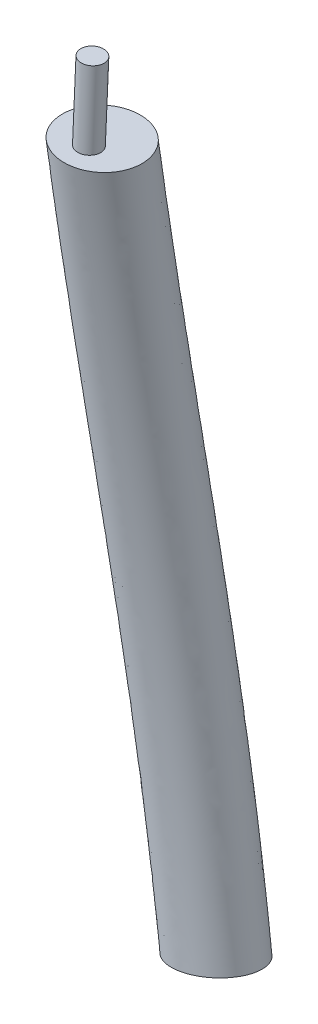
ISO-10303-21;
HEADER;
FILE_DESCRIPTION(('STEP AP214'),'2;1');
FILE_NAME('part.step','',(''),(''),'','','');
FILE_SCHEMA(('AUTOMOTIVE_DESIGN { 1 0 10303 214 1 1 1 1 }'));
ENDSEC;
DATA;
#1=APPLICATION_CONTEXT('core data for automotive mechanical design processes');
#2=APPLICATION_PROTOCOL_DEFINITION('international standard','automotive_design',2000,#1);
#3=PRODUCT_CONTEXT('',#1,'mechanical');
#4=PRODUCT('Part','Part','',(#3));
#5=PRODUCT_RELATED_PRODUCT_CATEGORY('part','',(#4));
#6=PRODUCT_DEFINITION_FORMATION('','',#4);
#7=PRODUCT_DEFINITION_CONTEXT('part definition',#1,'design');
#8=PRODUCT_DEFINITION('design','',#6,#7);
#9=PRODUCT_DEFINITION_SHAPE('','',#8);
#10=(LENGTH_UNIT() NAMED_UNIT(*) SI_UNIT(.MILLI.,.METRE.));
#11=(NAMED_UNIT(*) PLANE_ANGLE_UNIT() SI_UNIT($,.RADIAN.));
#12=(NAMED_UNIT(*) SI_UNIT($,.STERADIAN.) SOLID_ANGLE_UNIT());
#13=UNCERTAINTY_MEASURE_WITH_UNIT(LENGTH_MEASURE(1.E-05),#10,'distance_accuracy_value','');
#14=(GEOMETRIC_REPRESENTATION_CONTEXT(3) GLOBAL_UNCERTAINTY_ASSIGNED_CONTEXT((#13)) GLOBAL_UNIT_ASSIGNED_CONTEXT((#10,
#11,#12)) REPRESENTATION_CONTEXT('',''));
#15=CARTESIAN_POINT('',(0.,0.,0.));
#16=DIRECTION('',(0.,0.,1.));
#17=DIRECTION('',(1.,0.,0.));
#18=AXIS2_PLACEMENT_3D('',#15,#16,#17);
#19=CARTESIAN_POINT('',(-46.8725463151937,-4.55928526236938,-31.8));
#20=DIRECTION('',(-0.0440198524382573,-0.999030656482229,0.));
#21=DIRECTION('',(0.999030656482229,-0.0440198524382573,0.));
#22=AXIS2_PLACEMENT_3D('',#19,#20,#21);
#23=PLANE('',#22);
#24=CARTESIAN_POINT('',(-47.8749737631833,-4.51511573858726,-31.8));
#25=DIRECTION('',(0.0440198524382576,0.999030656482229,0.));
#26=DIRECTION('',(-0.999030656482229,0.0440198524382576,0.));
#27=AXIS2_PLACEMENT_3D('',#24,#25,#26);
#28=CIRCLE('',#27,0.146623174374);
#29=CARTESIAN_POINT('',(-48.0214548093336,-4.50866140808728,-31.8));
#30=VERTEX_POINT('',#29);
#31=EDGE_CURVE('E18',#30,#30,#28,.F.);
#32=ORIENTED_EDGE('',*,*,#31,.F.);
#33=EDGE_LOOP('',(#32));
#34=FACE_BOUND('',#33,.T.);
#35=ADVANCED_FACE('F15',(#34),#23,.F.);
#36=CARTESIAN_POINT('',(-47.8969836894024,-5.01463106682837,-31.8));
#37=DIRECTION('',(0.0440198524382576,0.999030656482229,0.));
#38=DIRECTION('',(-0.999030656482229,0.0440198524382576,0.));
#39=AXIS2_PLACEMENT_3D('',#36,#37,#38);
#40=CYLINDRICAL_SURFACE('',#39,0.146623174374);
#41=ORIENTED_EDGE('',*,*,#31,.T.);
#42=EDGE_LOOP('',(#41));
#43=FACE_BOUND('',#42,.T.);
#44=CARTESIAN_POINT('',(-47.9189936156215,-5.51414639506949,-31.8));
#45=DIRECTION('',(0.0440198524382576,0.999030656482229,0.));
#46=DIRECTION('',(-0.999030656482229,0.0440198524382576,0.));
#47=AXIS2_PLACEMENT_3D('',#44,#45,#46);
#48=CIRCLE('',#47,0.146623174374);
#49=CARTESIAN_POINT('',(-48.0654746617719,-5.50769206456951,-31.8));
#50=VERTEX_POINT('',#49);
#51=EDGE_CURVE('E27',#50,#50,#48,.F.);
#52=ORIENTED_EDGE('',*,*,#51,.F.);
#53=EDGE_LOOP('',(#52));
#54=FACE_BOUND('',#53,.T.);
#55=ADVANCED_FACE('F49',(#43,#54),#40,.T.);
#56=CARTESIAN_POINT('',(-46.3190586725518,-14.4380602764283,-32.787813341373));
#57=DIRECTION('',(0.108309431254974,-0.981933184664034,0.155165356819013));
#58=DIRECTION('',(0.,-0.156083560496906,-0.987743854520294));
#59=AXIS2_PLACEMENT_3D('',#56,#57,#58);
#60=PLANE('',#59);
#61=CARTESIAN_POINT('',(-47.8144470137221,-14.6059029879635,-32.8061529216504));
#62=CARTESIAN_POINT('',(-47.8136230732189,-14.6101935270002,-32.8338798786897));
#63=CARTESIAN_POINT('',(-47.8104456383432,-14.6142238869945,-32.8616031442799));
#64=CARTESIAN_POINT('',(-47.7994537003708,-14.621647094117,-32.9162520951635));
#65=CARTESIAN_POINT('',(-47.791629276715,-14.6250385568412,-32.9431759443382));
#66=CARTESIAN_POINT('',(-47.7715712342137,-14.6310763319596,-32.9953858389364));
#67=CARTESIAN_POINT('',(-47.7593424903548,-14.6337234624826,-33.0206736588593));
#68=CARTESIAN_POINT('',(-47.730819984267,-14.6382018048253,-33.0689234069));
#69=CARTESIAN_POINT('',(-47.7145259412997,-14.6400329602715,-33.0918851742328));
#70=CARTESIAN_POINT('',(-47.6783374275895,-14.6428271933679,-33.1348284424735));
#71=CARTESIAN_POINT('',(-47.6584432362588,-14.6437903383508,-33.1548101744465));
#72=CARTESIAN_POINT('',(-47.6156163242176,-14.6448214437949,-33.191229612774));
#73=CARTESIAN_POINT('',(-47.5926833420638,-14.6448893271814,-33.2076670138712));
#74=CARTESIAN_POINT('',(-47.5444479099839,-14.6441280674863,-33.2365191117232));
#75=CARTESIAN_POINT('',(-47.5191470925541,-14.6432995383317,-33.2489365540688));
#76=CARTESIAN_POINT('',(-47.4668462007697,-14.6407682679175,-33.2694252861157));
#77=CARTESIAN_POINT('',(-47.4398439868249,-14.6390644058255,-33.2774909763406));
#78=CARTESIAN_POINT('',(-47.384954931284,-14.6348316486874,-33.2890187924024));
#79=CARTESIAN_POINT('',(-47.3570686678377,-14.6323032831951,-33.2924838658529));
#80=CARTESIAN_POINT('',(-47.3011865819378,-14.6264929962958,-33.2947217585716));
#81=CARTESIAN_POINT('',(-47.2731907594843,-14.623211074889,-33.2934945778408));
#82=CARTESIAN_POINT('',(-47.2178664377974,-14.6159845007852,-33.2863804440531));
#83=CARTESIAN_POINT('',(-47.1905383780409,-14.6120394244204,-33.2804905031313));
#84=CARTESIAN_POINT('',(-47.1373793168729,-14.6036055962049,-33.2642250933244));
#85=CARTESIAN_POINT('',(-47.1115464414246,-14.5991175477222,-33.2538553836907));
#86=CARTESIAN_POINT('',(-47.062054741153,-14.5897176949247,-33.228916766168));
#87=CARTESIAN_POINT('',(-47.0383974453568,-14.5848055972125,-33.2143449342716));
#88=CARTESIAN_POINT('',(-46.9939514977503,-14.5747003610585,-33.1814203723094));
#89=CARTESIAN_POINT('',(-46.9731625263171,-14.56950725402,-33.1630680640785));
#90=CARTESIAN_POINT('',(-46.9350382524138,-14.5589864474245,-33.1231009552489));
#91=CARTESIAN_POINT('',(-46.9177032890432,-14.5536587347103,-33.1014858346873));
#92=CARTESIAN_POINT('',(-46.8869830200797,-14.5430206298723,-33.055608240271));
#93=CARTESIAN_POINT('',(-46.8735973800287,-14.5377102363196,-33.0313459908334));
#94=CARTESIAN_POINT('',(-46.8511397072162,-14.5272515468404,-32.9808362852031));
#95=CARTESIAN_POINT('',(-46.8420731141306,-14.5221034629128,-32.9545863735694));
#96=CARTESIAN_POINT('',(-46.828552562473,-14.5121309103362,-32.9009147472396));
#97=CARTESIAN_POINT('',(-46.8240874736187,-14.5073056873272,-32.8734960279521));
#98=CARTESIAN_POINT('',(-46.8213131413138,-14.5012766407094,-32.8372789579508));
#99=CARTESIAN_POINT('',(-46.8208822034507,-14.4998643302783,-32.8286422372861));
#100=CARTESIAN_POINT('',(-46.820578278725,-14.4977796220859,-32.8156617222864));
#101=CARTESIAN_POINT('',(-46.8205342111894,-14.4970895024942,-32.8113251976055));
#102=CARTESIAN_POINT('',(-46.8205544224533,-14.4960634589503,-32.804817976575));
#103=CARTESIAN_POINT('',(-46.8205755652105,-14.4957228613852,-32.8026478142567));
#104=CARTESIAN_POINT('',(-46.8206465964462,-14.4950447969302,-32.7983072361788));
#105=CARTESIAN_POINT('',(-46.8206964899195,-14.4947073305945,-32.7961368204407));
#106=CARTESIAN_POINT('',(-46.8215822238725,-14.4900844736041,-32.7662637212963));
#107=CARTESIAN_POINT('',(-46.8247595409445,-14.4860537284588,-32.7385381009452));
#108=CARTESIAN_POINT('',(-46.8357497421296,-14.4786289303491,-32.6838802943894));
#109=CARTESIAN_POINT('',(-46.8435755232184,-14.4752366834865,-32.656950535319));
#110=CARTESIAN_POINT('',(-46.8636363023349,-14.4691982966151,-32.604734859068));
#111=CARTESIAN_POINT('',(-46.8758649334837,-14.4665510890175,-32.5794466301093));
#112=CARTESIAN_POINT('',(-46.9043873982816,-14.4620726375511,-32.5311962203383));
#113=CARTESIAN_POINT('',(-46.9206816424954,-14.4602414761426,-32.5082342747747));
#114=CARTESIAN_POINT('',(-46.9568699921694,-14.4574472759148,-32.4652913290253));
#115=CARTESIAN_POINT('',(-46.9767636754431,-14.4564841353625,-32.4453099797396));
#116=CARTESIAN_POINT('',(-47.0195904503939,-14.4554529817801,-32.4088903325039));
#117=CARTESIAN_POINT('',(-47.0425239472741,-14.4553850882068,-32.3924525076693));
#118=CARTESIAN_POINT('',(-47.0907599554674,-14.4561463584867,-32.3636000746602));
#119=CARTESIAN_POINT('',(-47.1160607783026,-14.4569748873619,-32.3511826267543));
#120=CARTESIAN_POINT('',(-47.1683616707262,-14.4595061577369,-32.3306938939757));
#121=CARTESIAN_POINT('',(-47.195363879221,-14.4612100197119,-32.3226282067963));
#122=CARTESIAN_POINT('',(-47.2502529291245,-14.4654427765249,-32.3111003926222));
#123=CARTESIAN_POINT('',(-47.2781391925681,-14.4679711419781,-32.3076353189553));
#124=CARTESIAN_POINT('',(-47.3340212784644,-14.4737814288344,-32.3053974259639));
#125=CARTESIAN_POINT('',(-47.3620171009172,-14.4770633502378,-32.3066246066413));
#126=CARTESIAN_POINT('',(-47.4173414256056,-14.4842899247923,-32.3137387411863));
#127=CARTESIAN_POINT('',(-47.4446694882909,-14.4882350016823,-32.3196286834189));
#128=CARTESIAN_POINT('',(-47.4978285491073,-14.496668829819,-32.3358940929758));
#129=CARTESIAN_POINT('',(-47.5236614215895,-14.5011568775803,-32.3462638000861));
#130=CARTESIAN_POINT('',(-47.5731528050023,-14.5105566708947,-32.3712022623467));
#131=CARTESIAN_POINT('',(-47.5968098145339,-14.5154687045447,-32.3857738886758));
#132=CARTESIAN_POINT('',(-47.6412558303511,-14.5255739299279,-32.4186983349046));
#133=CARTESIAN_POINT('',(-47.6620450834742,-14.5307670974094,-32.4370508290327));
#134=CARTESIAN_POINT('',(-47.7001694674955,-14.5412879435,-32.4770181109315));
#135=CARTESIAN_POINT('',(-47.7175043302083,-14.5466156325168,-32.4986331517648));
#136=CARTESIAN_POINT('',(-47.7482245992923,-14.557253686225,-32.5445104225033));
#137=CARTESIAN_POINT('',(-47.761610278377,-14.5625640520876,-32.5687724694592));
#138=CARTESIAN_POINT('',(-47.7840666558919,-14.5730222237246,-32.6192798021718));
#139=CARTESIAN_POINT('',(-47.7931325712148,-14.5781698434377,-32.6455272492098));
#140=CARTESIAN_POINT('',(-47.8066535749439,-14.5881417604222,-32.6991945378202));
#141=CARTESIAN_POINT('',(-47.811118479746,-14.5929667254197,-32.7266117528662));
#142=CARTESIAN_POINT('',(-47.8145573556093,-14.6004364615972,-32.7714820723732));
#143=CARTESIAN_POINT('',(-47.8149621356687,-14.6032205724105,-32.7888182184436));
#144=CARTESIAN_POINT('',(-47.8144470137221,-14.6059029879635,-32.8061529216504));
#145=B_SPLINE_CURVE_WITH_KNOTS('',3,(#61,#62,#63,#64,#65,#66,#67,#68,#69,#70,#71,#72,#73,#74,
#75,#76,#77,#78,#79,#80,#81,#82,#83,#84,#85,#86,#87,#88,#89,#90,#91,#92,#93,#94,#95,#96,#97,#98,
#99,#100,#101,#102,#103,#104,#105,#106,#107,#108,#109,#110,#111,#112,#113,#114,#115,#116,#117,
#118,#119,#120,#121,#122,#123,#124,#125,#126,#127,#128,#129,#130,#131,#132,#133,#134,#135,#136,
#137,#138,#139,#140,#141,#142,#143,#144),.UNSPECIFIED.,.T.,.F.,(4,2,2,2,2,2,2,2,2,2,2,2,2,2,2,2,
2,2,2,2,2,2,2,2,2,2,2,2,2,2,2,2,2,2,2,2,2,2,2,2,2,4),(0.,0.0841521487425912,0.168484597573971,
0.252723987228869,0.336969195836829,0.421207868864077,0.505453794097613,0.589642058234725,
0.673938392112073,0.758180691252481,0.842422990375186,0.926719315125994,1.01090758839,
1.0951545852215,1.17939218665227,1.26363805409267,1.34787678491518,1.43222133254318,
1.51636138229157,1.5426396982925,1.55581189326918,1.56240213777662,1.56899352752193,
1.65311857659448,1.73747812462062,1.82171616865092,1.90596272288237,1.99019940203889,
2.0744473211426,2.15863560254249,2.24293191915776,2.32717421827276,2.41141651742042,
2.49571285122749,2.57990111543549,2.66414704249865,2.74838571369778,2.83263092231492,
2.91687031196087,3.00120276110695,3.08535490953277,3.13796625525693),.UNSPECIFIED.);
#146=CARTESIAN_POINT('',(-46.8207608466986,-14.494371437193,-32.793966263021));
#147=VERTEX_POINT('',#146);
#148=EDGE_CURVE('E22',#147,#147,#145,.T.);
#149=ORIENTED_EDGE('',*,*,#148,.T.);
#150=EDGE_LOOP('',(#149));
#151=FACE_BOUND('',#150,.T.);
#152=ADVANCED_FACE('F45',(#151),#60,.T.);
#153=CARTESIAN_POINT('',(-46.916566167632,-5.55831591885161,-31.8));
#154=DIRECTION('',(0.0440198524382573,0.999030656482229,0.));
#155=DIRECTION('',(-0.999030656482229,0.0440198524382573,0.));
#156=AXIS2_PLACEMENT_3D('',#153,#154,#155);
#157=PLANE('',#156);
#158=ORIENTED_EDGE('',*,*,#51,.T.);
#159=EDGE_LOOP('',(#158));
#160=FACE_BOUND('',#159,.T.);
#161=CARTESIAN_POINT('',(-47.4085223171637,-5.53663906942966,-31.9565018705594));
#162=CARTESIAN_POINT('',(-47.4084971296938,-5.53664017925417,-31.9633764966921));
#163=CARTESIAN_POINT('',(-47.4086136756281,-5.53663504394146,-31.9702504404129));
#164=CARTESIAN_POINT('',(-47.4099114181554,-5.53657786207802,-32.0046954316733));
#165=CARTESIAN_POINT('',(-47.4132423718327,-5.53643109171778,-32.0322246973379));
#166=CARTESIAN_POINT('',(-47.4244818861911,-5.5359358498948,-32.08669353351));
#167=CARTESIAN_POINT('',(-47.4324510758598,-5.53558470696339,-32.1136202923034));
#168=CARTESIAN_POINT('',(-47.4528069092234,-5.534687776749,-32.1657915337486));
#169=CARTESIAN_POINT('',(-47.4651991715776,-5.53414174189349,-32.1910338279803));
#170=CARTESIAN_POINT('',(-47.4940327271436,-5.53287126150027,-32.2390406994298));
#171=CARTESIAN_POINT('',(-47.5104691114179,-5.53214703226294,-32.2618082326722));
#172=CARTESIAN_POINT('',(-47.5469324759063,-5.53054036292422,-32.3042545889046));
#173=CARTESIAN_POINT('',(-47.5669595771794,-5.52965791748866,-32.323933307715));
#174=CARTESIAN_POINT('',(-47.6100046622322,-5.52776124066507,-32.3596185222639));
#175=CARTESIAN_POINT('',(-47.6330187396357,-5.52674718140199,-32.3756297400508));
#176=CARTESIAN_POINT('',(-47.6814041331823,-5.52461519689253,-32.4035635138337));
#177=CARTESIAN_POINT('',(-47.7067755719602,-5.52349726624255,-32.4154858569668));
#178=CARTESIAN_POINT('',(-47.7591685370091,-5.5211886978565,-32.4349151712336));
#179=CARTESIAN_POINT('',(-47.7861909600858,-5.51999802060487,-32.4424197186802));
#180=CARTESIAN_POINT('',(-47.8411457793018,-5.5175765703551,-32.4528067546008));
#181=CARTESIAN_POINT('',(-47.8690793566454,-5.51634574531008,-32.4556829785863));
#182=CARTESIAN_POINT('',(-47.9250793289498,-5.51387824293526,-32.4567225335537));
#183=CARTESIAN_POINT('',(-47.9531458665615,-5.5126415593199,-32.4548781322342));
#184=CARTESIAN_POINT('',(-48.0086227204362,-5.51019710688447,-32.4465136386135));
#185=CARTESIAN_POINT('',(-48.0360318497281,-5.50898939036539,-32.4399856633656));
#186=CARTESIAN_POINT('',(-48.0894718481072,-5.50663468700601,-32.422403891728));
#187=CARTESIAN_POINT('',(-48.1154973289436,-5.50548793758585,-32.4113336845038));
#188=CARTESIAN_POINT('',(-48.1652856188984,-5.50329413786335,-32.3850067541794));
#189=CARTESIAN_POINT('',(-48.1890520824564,-5.50224692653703,-32.3697569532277));
#190=CARTESIAN_POINT('',(-48.2337947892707,-5.50027544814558,-32.3354231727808));
#191=CARTESIAN_POINT('',(-48.2547591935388,-5.49935170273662,-32.316323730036));
#192=CARTESIAN_POINT('',(-48.2931598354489,-5.49765967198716,-32.2749022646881));
#193=CARTESIAN_POINT('',(-48.3106008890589,-5.49689117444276,-32.2525847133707));
#194=CARTESIAN_POINT('',(-48.3415183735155,-5.49552887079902,-32.2052938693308));
#195=CARTESIAN_POINT('',(-48.3549884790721,-5.49493534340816,-32.1803164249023));
#196=CARTESIAN_POINT('',(-48.3775279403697,-5.49394219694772,-32.1284908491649));
#197=CARTESIAN_POINT('',(-48.3866015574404,-5.49354239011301,-32.1016445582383));
#198=CARTESIAN_POINT('',(-48.4028104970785,-5.49282818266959,-32.0356982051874));
#199=CARTESIAN_POINT('',(-48.4076978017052,-5.49261283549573,-31.9960131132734));
#200=CARTESIAN_POINT('',(-48.4079520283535,-5.49260163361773,-31.9283449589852));
#201=CARTESIAN_POINT('',(-48.4056888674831,-5.49270135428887,-31.9003401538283));
#202=CARTESIAN_POINT('',(-48.396501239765,-5.49310618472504,-31.8450640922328));
#203=CARTESIAN_POINT('',(-48.3895724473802,-5.49341148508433,-31.8177935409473));
#204=CARTESIAN_POINT('',(-48.3712360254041,-5.49421943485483,-31.7648203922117));
#205=CARTESIAN_POINT('',(-48.3598300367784,-5.49472201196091,-31.7391172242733));
#206=CARTESIAN_POINT('',(-48.3328609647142,-5.49591033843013,-31.6899961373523));
#207=CARTESIAN_POINT('',(-48.3172978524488,-5.49659608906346,-31.6665782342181));
#208=CARTESIAN_POINT('',(-48.282488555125,-5.49812987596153,-31.6227393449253));
#209=CARTESIAN_POINT('',(-48.2632492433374,-5.49897760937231,-31.6023128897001));
#210=CARTESIAN_POINT('',(-48.2216158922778,-5.5008120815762,-31.5649843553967));
#211=CARTESIAN_POINT('',(-48.1992217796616,-5.50179882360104,-31.5480823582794));
#212=CARTESIAN_POINT('',(-48.1519425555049,-5.50388206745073,-31.5182964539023));
#213=CARTESIAN_POINT('',(-48.1270601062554,-5.50497845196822,-31.5054083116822));
#214=CARTESIAN_POINT('',(-48.0754575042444,-5.50725219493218,-31.4839708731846));
#215=CARTESIAN_POINT('',(-48.0487350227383,-5.50842965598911,-31.4754271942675));
#216=CARTESIAN_POINT('',(-47.9942037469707,-5.51083244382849,-31.462929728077));
#217=CARTESIAN_POINT('',(-47.9663936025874,-5.51205783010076,-31.4589818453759));
#218=CARTESIAN_POINT('',(-47.9105052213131,-5.51452041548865,-31.4557982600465));
#219=CARTESIAN_POINT('',(-47.8824269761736,-5.51575761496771,-31.4565627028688));
#220=CARTESIAN_POINT('',(-47.8266782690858,-5.51821404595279,-31.462786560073));
#221=CARTESIAN_POINT('',(-47.7990099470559,-5.51943318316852,-31.468265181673));
#222=CARTESIAN_POINT('',(-47.7450142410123,-5.52181237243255,-31.4837705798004));
#223=CARTESIAN_POINT('',(-47.7186852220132,-5.5229724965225,-31.4937916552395));
#224=CARTESIAN_POINT('',(-47.667962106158,-5.52520748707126,-31.5181442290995));
#225=CARTESIAN_POINT('',(-47.6435765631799,-5.52628197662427,-31.5324935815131));
#226=CARTESIAN_POINT('',(-47.5975535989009,-5.52830986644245,-31.5650775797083));
#227=CARTESIAN_POINT('',(-47.5759159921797,-5.52926327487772,-31.5833119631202));
#228=CARTESIAN_POINT('',(-47.5359565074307,-5.53102399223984,-31.6231924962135));
#229=CARTESIAN_POINT('',(-47.5176415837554,-5.53183099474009,-31.6448456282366));
#230=CARTESIAN_POINT('',(-47.4849062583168,-5.53327339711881,-31.690922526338));
#231=CARTESIAN_POINT('',(-47.4704855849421,-5.53390880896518,-31.715346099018));
#232=CARTESIAN_POINT('',(-47.4459453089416,-5.53499011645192,-31.7662848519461));
#233=CARTESIAN_POINT('',(-47.4358280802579,-5.53543590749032,-31.792801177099));
#234=CARTESIAN_POINT('',(-47.4202173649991,-5.53612375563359,-31.8471178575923));
#235=CARTESIAN_POINT('',(-47.4147150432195,-5.53636620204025,-31.8749156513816));
#236=CARTESIAN_POINT('',(-47.4096117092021,-5.53659106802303,-31.9207439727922));
#237=CARTESIAN_POINT('',(-47.4085878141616,-5.536636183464,-31.9386252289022));
#238=CARTESIAN_POINT('',(-47.4085223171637,-5.53663906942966,-31.9565018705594));
#239=B_SPLINE_CURVE_WITH_KNOTS('',3,(#161,#162,#163,#164,#165,#166,#167,#168,#169,#170,#171,
#172,#173,#174,#175,#176,#177,#178,#179,#180,#181,#182,#183,#184,#185,#186,#187,#188,#189,#190,
#191,#192,#193,#194,#195,#196,#197,#198,#199,#200,#201,#202,#203,#204,#205,#206,#207,#208,#209,
#210,#211,#212,#213,#214,#215,#216,#217,#218,#219,#220,#221,#222,#223,#224,#225,#226,#227,#228,
#229,#230,#231,#232,#233,#234,#235,#236,#237,#238),.UNSPECIFIED.,.T.,.F.,(4,2,2,2,2,2,2,2,2,2,2,
2,2,2,2,2,2,2,2,2,2,2,2,2,2,2,2,2,2,2,2,2,2,2,2,2,2,2,4),(0.,0.0206227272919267,
0.103381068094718,0.187246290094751,0.271218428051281,0.355089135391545,0.438962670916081,
0.522727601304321,0.606496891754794,0.690312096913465,0.774240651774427,0.858306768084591,
0.942514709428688,1.02702960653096,1.11140536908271,1.19612706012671,1.28073215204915,
1.36547129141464,1.4501281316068,1.56883985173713,1.65276876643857,1.73677559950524,
1.82075167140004,1.90472832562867,1.98854948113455,2.07237258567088,2.15610694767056,
2.23994930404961,2.32389926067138,2.40785180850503,2.49214803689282,2.57633875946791,
2.66088162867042,2.74541879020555,2.83013089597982,2.91483709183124,2.99958995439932,
3.08418018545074,3.13780711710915),.UNSPECIFIED.);
#240=CARTESIAN_POINT('',(-47.4085223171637,-5.53663906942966,-31.9565018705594));
#241=VERTEX_POINT('',#240);
#242=EDGE_CURVE('E10',#241,#241,#239,.T.);
#243=ORIENTED_EDGE('',*,*,#242,.T.);
#244=EDGE_LOOP('',(#243));
#245=FACE_BOUND('',#244,.T.);
#246=ADVANCED_FACE('F42',(#160,#245),#157,.T.);
#247=CARTESIAN_POINT('',(-47.3769468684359,-4.53706008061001,-31.8));
#248=CARTESIAN_POINT('',(-47.3769468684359,-4.53706008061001,-29.8));
#249=CARTESIAN_POINT('',(-49.3750081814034,-4.44902037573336,-30.8));
#250=CARTESIAN_POINT('',(-49.3750081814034,-4.44902037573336,-32.8));
#251=CARTESIAN_POINT('',(-47.3769468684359,-4.53706008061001,-33.8));
#252=CARTESIAN_POINT('',(-47.3769468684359,-4.53706008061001,-31.8));
#253=CARTESIAN_POINT('',(-47.463907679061,-6.51063588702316,-32.110309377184));
#254=CARTESIAN_POINT('',(-47.4790177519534,-6.50997009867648,-30.1103093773));
#255=CARTESIAN_POINT('',(-49.4737625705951,-6.5184570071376,-31.125434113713));
#256=CARTESIAN_POINT('',(-49.4586524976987,-6.51912279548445,-33.12543411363));
#257=CARTESIAN_POINT('',(-47.4487976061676,-6.51130167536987,-34.11030937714));
#258=CARTESIAN_POINT('',(-47.463907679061,-6.51063588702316,-32.110309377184));
#259=CARTESIAN_POINT('',(-47.429164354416,-8.48946014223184,-32.421344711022));
#260=CARTESIAN_POINT('',(-47.4548310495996,-8.4514044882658,-30.4214876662));
#261=CARTESIAN_POINT('',(-49.4426244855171,-8.57550162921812,-31.448733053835));
#262=CARTESIAN_POINT('',(-49.4169578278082,-8.61355728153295,-33.44859008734));
#263=CARTESIAN_POINT('',(-47.403497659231,-8.52751579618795,-34.42120190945));
#264=CARTESIAN_POINT('',(-47.429164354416,-8.48946014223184,-32.421344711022));
#265=CARTESIAN_POINT('',(-47.2728748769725,-10.4663604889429,-32.669002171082));
#266=CARTESIAN_POINT('',(-47.3068685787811,-10.3528632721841,-30.66895575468));
#267=CARTESIAN_POINT('',(-49.2817221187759,-10.5924500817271,-31.69627057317));
#268=CARTESIAN_POINT('',(-49.2477285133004,-10.7059468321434,-33.69631707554));
#269=CARTESIAN_POINT('',(-47.2388812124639,-10.5798572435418,-34.66904863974));
#270=CARTESIAN_POINT('',(-47.2728748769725,-10.4663604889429,-32.669002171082));
#271=CARTESIAN_POINT('',(-47.0473392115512,-12.4756801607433,-32.793966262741));
#272=CARTESIAN_POINT('',(-47.0951033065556,-12.2659974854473,-30.80315640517));
#273=CARTESIAN_POINT('',(-49.0587265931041,-12.5927169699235,-31.8229346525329));
#274=CARTESIAN_POINT('',(-49.0109624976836,-12.8023996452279,-33.81374450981));
#275=CARTESIAN_POINT('',(-46.999575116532,-12.6853628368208,-34.78477611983));
#276=CARTESIAN_POINT('',(-47.0473392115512,-12.4756801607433,-32.793966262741));
#277=CARTESIAN_POINT('',(-46.8207608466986,-14.494371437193,-32.793966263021));
#278=CARTESIAN_POINT('',(-46.8793054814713,-14.1886399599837,-30.818339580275));
#279=CARTESIAN_POINT('',(-48.8374054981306,-14.5645688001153,-31.830526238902));
#280=CARTESIAN_POINT('',(-48.7788608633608,-14.8703002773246,-33.80615292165));
#281=CARTESIAN_POINT('',(-46.7622162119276,-14.8001029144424,-34.76959294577));
#282=CARTESIAN_POINT('',(-46.8207608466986,-14.494371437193,-32.793966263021));
#283=(BOUNDED_SURFACE() B_SPLINE_SURFACE(5,5,((#247,#248,#249,#250,#251,#252),(#253,#254,#255,
#256,#257,#258),(#259,#260,#261,#262,#263,#264),(#265,#266,#267,#268,#269,#270),(#271,#272,#273,
#274,#275,#276),(#277,#278,#279,#280,#281,#282)),.UNSPECIFIED.,.F.,.T.,
.F.) B_SPLINE_SURFACE_WITH_KNOTS((6,6),(6,6),(0.,10.1637294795),(0.,3.14159265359),
.UNSPECIFIED.) GEOMETRIC_REPRESENTATION_ITEM() RATIONAL_B_SPLINE_SURFACE(((1.,0.2,0.2,0.2,0.2,
1.),(1.,0.2,0.2,0.2,0.2,1.),(1.,0.2,0.2,0.2,0.2,1.),(1.,0.2,0.2,0.2,0.2,1.),(1.,0.2,0.2,0.2,0.2,
1.),(1.,0.2,0.2,0.2,0.2,1.))) REPRESENTATION_ITEM('') SURFACE());
#284=CARTESIAN_POINT('',(-46.8207608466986,-14.494371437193,-32.793966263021));
#285=CARTESIAN_POINT('',(-46.8260632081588,-14.4471302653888,-32.7939662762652));
#286=CARTESIAN_POINT('',(-46.8313655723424,-14.3998890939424,-32.7938841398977));
#287=CARTESIAN_POINT('',(-46.8419651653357,-14.3054202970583,-32.793555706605));
#288=CARTESIAN_POINT('',(-46.8472623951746,-14.2581926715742,-32.7933094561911));
#289=CARTESIAN_POINT('',(-46.8578479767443,-14.1637521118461,-32.7926530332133));
#290=CARTESIAN_POINT('',(-46.8631363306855,-14.1165391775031,-32.7922429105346));
#291=CARTESIAN_POINT('',(-46.8737004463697,-14.0221290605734,-32.7912590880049));
#292=CARTESIAN_POINT('',(-46.8789762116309,-13.974931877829,-32.7906854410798));
#293=CARTESIAN_POINT('',(-46.8895114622,-13.8805542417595,-32.7893749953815));
#294=CARTESIAN_POINT('',(-46.8947709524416,-13.8333737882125,-32.7886382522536));
#295=CARTESIAN_POINT('',(-46.9052699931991,-13.7390305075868,-32.7870021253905));
#296=CARTESIAN_POINT('',(-46.9105095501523,-13.6918676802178,-32.7861027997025));
#297=CARTESIAN_POINT('',(-46.9209650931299,-13.5975604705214,-32.7841421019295));
#298=CARTESIAN_POINT('',(-46.9261810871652,-13.5504160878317,-32.7830807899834));
#299=CARTESIAN_POINT('',(-46.9365859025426,-13.4561465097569,-32.7807967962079));
#300=CARTESIAN_POINT('',(-46.9417747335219,-13.409021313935,-32.7795741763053));
#301=CARTESIAN_POINT('',(-46.9521216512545,-13.3147907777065,-32.7769683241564));
#302=CARTESIAN_POINT('',(-46.957279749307,-13.2676854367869,-32.7755851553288));
#303=CARTESIAN_POINT('',(-46.967561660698,-13.1734952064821,-32.7726590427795));
#304=CARTESIAN_POINT('',(-46.9726854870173,-13.1264103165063,-32.7711161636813));
#305=CARTESIAN_POINT('',(-46.9828953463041,-13.0322615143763,-32.7678715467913));
#306=CARTESIAN_POINT('',(-46.9879813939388,-12.9851976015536,-32.7661698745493));
#307=CARTESIAN_POINT('',(-46.9981122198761,-12.8910912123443,-32.7626086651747));
#308=CARTESIAN_POINT('',(-47.0031570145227,-12.8440487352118,-32.7607491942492));
#309=CARTESIAN_POINT('',(-47.0132018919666,-12.7499856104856,-32.7568734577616));
#310=CARTESIAN_POINT('',(-47.0182019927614,-12.7029649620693,-32.7548572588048));
#311=CARTESIAN_POINT('',(-47.0281540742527,-12.6089458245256,-32.7506692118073));
#312=CARTESIAN_POINT('',(-47.0331060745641,-12.5619473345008,-32.7484974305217));
#313=CARTESIAN_POINT('',(-47.0429585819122,-12.4679727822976,-32.7439994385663));
#314=CARTESIAN_POINT('',(-47.0478591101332,-12.4209967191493,-32.7416732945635));
#315=CARTESIAN_POINT('',(-47.0576053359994,-12.3270672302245,-32.7368678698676));
#316=CARTESIAN_POINT('',(-47.0624510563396,-12.2801138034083,-32.7343886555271));
#317=CARTESIAN_POINT('',(-47.0720843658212,-12.1862297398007,-32.7292784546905));
#318=CARTESIAN_POINT('',(-47.0768719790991,-12.1392991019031,-32.7266475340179));
#319=CARTESIAN_POINT('',(-47.0863858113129,-12.0454607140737,-32.7212353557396));
#320=CARTESIAN_POINT('',(-47.0911120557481,-11.9985529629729,-32.7184541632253));
#321=CARTESIAN_POINT('',(-47.100499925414,-11.9047603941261,-32.7127429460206));
#322=CARTESIAN_POINT('',(-47.1051615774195,-11.8578755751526,-32.7098129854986));
#323=CARTESIAN_POINT('',(-47.1144170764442,-11.7641288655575,-32.7038058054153));
#324=CARTESIAN_POINT('',(-47.1190109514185,-11.7172669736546,-32.7007286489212));
#325=CARTESIAN_POINT('',(-47.1281277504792,-11.6235660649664,-32.6944287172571));
#326=CARTESIAN_POINT('',(-47.1326507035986,-11.5767270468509,-32.691206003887));
#327=CARTESIAN_POINT('',(-47.1416225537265,-11.4830717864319,-32.6846166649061));
#328=CARTESIAN_POINT('',(-47.1460714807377,-11.4362555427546,-32.681250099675));
#329=CARTESIAN_POINT('',(-47.1548922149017,-11.3426456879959,-32.6743748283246));
#330=CARTESIAN_POINT('',(-47.1592640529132,-11.2958520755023,-32.6708661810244));
#331=CARTESIAN_POINT('',(-47.1679275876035,-11.2022872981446,-32.6637085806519));
#332=CARTESIAN_POINT('',(-47.1722193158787,-11.1555161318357,-32.6600596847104));
#333=CARTESIAN_POINT('',(-47.1807196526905,-11.061996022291,-32.6526234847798));
#334=CARTESIAN_POINT('',(-47.1849282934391,-11.0152470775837,-32.6488362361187));
#335=CARTESIAN_POINT('',(-47.1932595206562,-10.9217711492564,-32.6411252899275));
#336=CARTESIAN_POINT('',(-47.1973821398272,-10.8750441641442,-32.6372016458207));
#337=CARTESIAN_POINT('',(-47.2055384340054,-10.7816118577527,-32.6292199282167));
#338=CARTESIAN_POINT('',(-47.2095721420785,-10.7349065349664,-32.6251619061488));
#339=CARTESIAN_POINT('',(-47.2175477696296,-10.6415172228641,-32.6169135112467));
#340=CARTESIAN_POINT('',(-47.2214897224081,-10.5948332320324,-32.6127231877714));
#341=CARTESIAN_POINT('',(-47.2292790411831,-10.5014862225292,-32.6042123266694));
#342=CARTESIAN_POINT('',(-47.2331264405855,-10.4548232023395,-32.5998918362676));
#343=CARTESIAN_POINT('',(-47.2407239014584,-10.3615177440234,-32.5911228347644));
#344=CARTESIAN_POINT('',(-47.244473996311,-10.3148753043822,-32.5866743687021));
#345=CARTESIAN_POINT('',(-47.2518741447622,-10.2216105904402,-32.5776516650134));
#346=CARTESIAN_POINT('',(-47.255524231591,-10.1749883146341,-32.5730774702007));
#347=CARTESIAN_POINT('',(-47.2627217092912,-10.081763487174,-32.563805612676));
#348=CARTESIAN_POINT('',(-47.266269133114,-10.03516093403,-32.5591079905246));
#349=CARTESIAN_POINT('',(-47.2732586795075,-9.94197508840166,-32.5495916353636));
#350=CARTESIAN_POINT('',(-47.2767008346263,-9.89539179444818,-32.5447729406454));
#351=CARTESIAN_POINT('',(-47.2834772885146,-9.80224398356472,-32.5350168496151));
#352=CARTESIAN_POINT('',(-47.2868116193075,-9.75567946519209,-32.5300794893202));
#353=CARTESIAN_POINT('',(-47.2933699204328,-9.66256870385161,-32.5200885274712));
#354=CARTESIAN_POINT('',(-47.2965939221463,-9.61602245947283,-32.5150349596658));
#355=CARTESIAN_POINT('',(-47.3029291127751,-9.52294772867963,-32.5048140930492));
#356=CARTESIAN_POINT('',(-47.3060403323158,-9.47641924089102,-32.4996468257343));
#357=CARTESIAN_POINT('',(-47.3121475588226,-9.38337949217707,-32.4892011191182));
#358=CARTESIAN_POINT('',(-47.3151435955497,-9.33686822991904,-32.4839227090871));
#359=CARTESIAN_POINT('',(-47.3210181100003,-9.24386238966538,-32.4732573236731));
#360=CARTESIAN_POINT('',(-47.3238966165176,-9.19736781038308,-32.46787037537));
#361=CARTESIAN_POINT('',(-47.3295337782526,-9.10439478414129,-32.4569905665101));
#362=CARTESIAN_POINT('',(-47.3322924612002,-9.0579163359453,-32.4514977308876));
#363=CARTESIAN_POINT('',(-47.3376877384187,-8.96497501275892,-32.4404088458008));
#364=CARTESIAN_POINT('',(-47.3403243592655,-8.918512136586,-32.4348128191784));
#365=CARTESIAN_POINT('',(-47.3454733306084,-8.82560139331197,-32.4235202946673));
#366=CARTESIAN_POINT('',(-47.3479857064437,-8.77915352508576,-32.4178238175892));
#367=CARTESIAN_POINT('',(-47.3528840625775,-8.68627223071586,-32.4063331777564));
#368=CARTESIAN_POINT('',(-47.3552700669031,-8.6398388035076,-32.4005390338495));
#369=CARTESIAN_POINT('',(-47.359913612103,-8.54698582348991,-32.3888558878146));
#370=CARTESIAN_POINT('',(-47.3621711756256,-8.50056626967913,-32.3829669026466));
#371=CARTESIAN_POINT('',(-47.3665558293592,-8.40774047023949,-32.3710969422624));
#372=CARTESIAN_POINT('',(-47.3686829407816,-8.36133422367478,-32.3651159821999));
#373=CARTESIAN_POINT('',(-47.3728047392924,-8.26853447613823,-32.3530649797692));
#374=CARTESIAN_POINT('',(-47.374799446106,-8.22214097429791,-32.3469949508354));
#375=CARTESIAN_POINT('',(-47.3786545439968,-8.12936615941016,-32.3347687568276));
#376=CARTESIAN_POINT('',(-47.3805149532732,-8.08298484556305,-32.3286126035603));
#377=CARTESIAN_POINT('',(-47.3840996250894,-7.99023385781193,-32.316217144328));
#378=CARTESIAN_POINT('',(-47.3858239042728,-7.94386418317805,-32.3099778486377));
#379=CARTESIAN_POINT('',(-47.3891345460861,-7.85113593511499,-32.2974191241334));
#380=CARTESIAN_POINT('',(-47.3907209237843,-7.80477736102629,-32.2910997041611));
#381=CARTESIAN_POINT('',(-47.3937540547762,-7.71207078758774,-32.2783837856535));
#382=CARTESIAN_POINT('',(-47.3952008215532,-7.66572278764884,-32.2719872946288));
#383=CARTESIAN_POINT('',(-47.3979530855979,-7.57303685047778,-32.2591203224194));
#384=CARTESIAN_POINT('',(-47.3992585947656,-7.52669891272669,-32.2526498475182));
#385=CARTESIAN_POINT('',(-47.401726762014,-7.43403260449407,-32.2396380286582));
#386=CARTESIAN_POINT('',(-47.4028894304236,-7.3877042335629,-32.2330966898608));
#387=CARTESIAN_POINT('',(-47.4050703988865,-7.2950565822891,-32.2199462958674));
#388=CARTESIAN_POINT('',(-47.4060887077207,-7.24873730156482,-32.2133372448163));
#389=CARTESIAN_POINT('',(-47.407979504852,-7.15610737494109,-32.2000546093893));
#390=CARTESIAN_POINT('',(-47.4088520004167,-7.10979672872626,-32.1933810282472));
#391=CARTESIAN_POINT('',(-47.4104497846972,-7.0171836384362,-32.1799725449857));
#392=CARTESIAN_POINT('',(-47.4111750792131,-6.97088119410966,-32.1732376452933));
#393=CARTESIAN_POINT('',(-47.4124771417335,-6.87828410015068,-32.1597097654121));
#394=CARTESIAN_POINT('',(-47.4130539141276,-6.8319894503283,-32.1529167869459));
#395=CARTESIAN_POINT('',(-47.4140576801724,-6.73940756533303,-32.1392760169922));
#396=CARTESIAN_POINT('',(-47.4144846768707,-6.69312033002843,-32.1324282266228));
#397=CARTESIAN_POINT('',(-47.4151877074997,-6.60055292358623,-32.1186811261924));
#398=CARTESIAN_POINT('',(-47.4154637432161,-6.55427275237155,-32.1117818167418));
#399=CARTESIAN_POINT('',(-47.4158637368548,-6.46171915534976,-32.0979349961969));
#400=CARTESIAN_POINT('',(-47.4159876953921,-6.41544572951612,-32.0909874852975));
#401=CARTESIAN_POINT('',(-47.4160824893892,-6.32290533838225,-32.0770476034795));
#402=CARTESIAN_POINT('',(-47.4160533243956,-6.27663837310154,-32.0700552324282));
#403=CARTESIAN_POINT('',(-47.4158408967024,-6.18411065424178,-32.0560289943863));
#404=CARTESIAN_POINT('',(-47.4156576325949,-6.13784990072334,-32.0489951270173));
#405=CARTESIAN_POINT('',(-47.4151361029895,-6.04533439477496,-32.0348892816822));
#406=CARTESIAN_POINT('',(-47.4147978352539,-5.99907964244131,-32.0278173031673));
#407=CARTESIAN_POINT('',(-47.4139654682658,-5.90657596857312,-32.0136386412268));
#408=CARTESIAN_POINT('',(-47.413471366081,-5.86032704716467,-32.0065319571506));
#409=CARTESIAN_POINT('',(-47.4123265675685,-5.76783490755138,-31.9922873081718));
#410=CARTESIAN_POINT('',(-47.4116758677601,-5.72159168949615,-31.9851493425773));
#411=CARTESIAN_POINT('',(-47.4102172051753,-5.62911087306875,-31.9708455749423));
#412=CARTESIAN_POINT('',(-47.4094092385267,-5.582873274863,-31.9636797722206));
#413=CARTESIAN_POINT('',(-47.4085223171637,-5.53663906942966,-31.9565018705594));
#414=B_SPLINE_CURVE_WITH_KNOTS('',3,(#284,#285,#286,#287,#288,#289,#290,#291,#292,#293,#294,
#295,#296,#297,#298,#299,#300,#301,#302,#303,#304,#305,#306,#307,#308,#309,#310,#311,#312,#313,
#314,#315,#316,#317,#318,#319,#320,#321,#322,#323,#324,#325,#326,#327,#328,#329,#330,#331,#332,
#333,#334,#335,#336,#337,#338,#339,#340,#341,#342,#343,#344,#345,#346,#347,#348,#349,#350,#351,
#352,#353,#354,#355,#356,#357,#358,#359,#360,#361,#362,#363,#364,#365,#366,#367,#368,#369,#370,
#371,#372,#373,#374,#375,#376,#377,#378,#379,#380,#381,#382,#383,#384,#385,#386,#387,#388,#389,
#390,#391,#392,#393,#394,#395,#396,#397,#398,#399,#400,#401,#402,#403,#404,#405,#406,#407,#408,
#409,#410,#411,#412,#413),.UNSPECIFIED.,.F.,.F.,(4,2,2,2,2,2,2,2,2,2,2,2,2,2,2,2,2,2,2,2,2,2,2,
2,2,2,2,2,2,2,2,2,2,2,2,2,2,2,2,2,2,2,2,2,2,2,2,2,2,2,2,2,2,2,2,2,2,2,2,2,2,2,2,2,4),(0.,
0.142613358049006,0.285186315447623,0.427715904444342,0.570199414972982,0.712634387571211,
0.8550186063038,0.997350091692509,1.13962709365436,1.28184808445,1.42401175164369,
1.56611699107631,1.7081628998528,1.85014876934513,1.99207407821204,2.13393848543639,
2.27574182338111,2.41748409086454,2.55916544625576,2.70078620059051,2.84234681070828,
2.98384787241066,3.12529011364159,3.26667438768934,3.40800166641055,3.54927303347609,
3.6904896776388,3.83165288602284,3.9727640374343,4.11382459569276,4.25483610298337,
4.39580017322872,4.53671848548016,4.67759277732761,4.81842483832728,4.95921650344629,
5.09996964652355,5.24068617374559,5.3813680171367,5.52201712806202,5.66263547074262,
5.80322501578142,5.94378773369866,6.08432558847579,6.22484053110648,6.36533449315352,
6.50580938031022,6.64626706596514,6.78670938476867,6.92713812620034,7.06755502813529,
7.20796177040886,7.34835996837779,7.48875116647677,7.62913683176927,7.76951834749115,
7.90989700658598,8.05027400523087,8.19065043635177,8.3310272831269,8.4714054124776,
8.61178556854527,8.75216836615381,8.89255428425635,9.03294365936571),.UNSPECIFIED.);
#415=EDGE_CURVE('BSEAM38',#147,#241,#414,.T.);
#416=ORIENTED_EDGE('',*,*,#148,.F.);
#417=ORIENTED_EDGE('',*,*,#242,.F.);
#418=ORIENTED_EDGE('',*,*,#415,.T.);
#419=ORIENTED_EDGE('',*,*,#415,.F.);
#420=EDGE_LOOP('',(#416,#418,#417,#419));
#421=FACE_BOUND('',#420,.T.);
#422=ADVANCED_FACE('F38',(#421),#283,.F.);
#423=CLOSED_SHELL('',(#35,#55,#152,#246,#422));
#424=MANIFOLD_SOLID_BREP('B1',#423);
#425=ADVANCED_BREP_SHAPE_REPRESENTATION('',(#18,#424),#14);
#426=SHAPE_DEFINITION_REPRESENTATION(#9,#425);
ENDSEC;
END-ISO-10303-21;
